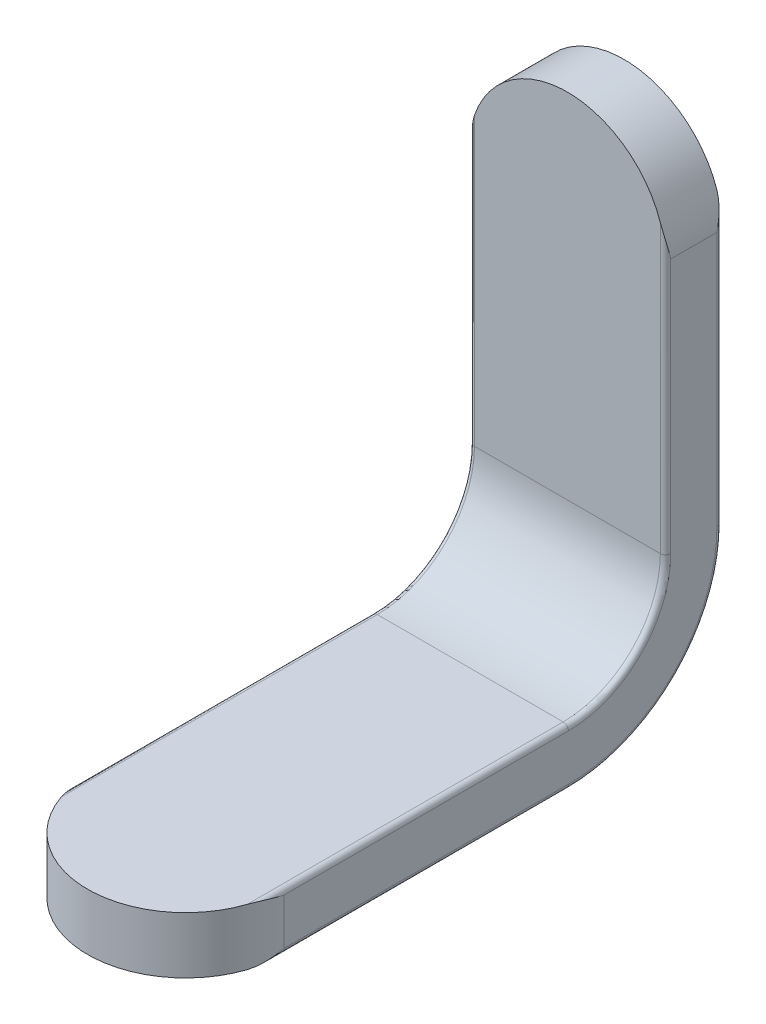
ISO-10303-21;
HEADER;
FILE_DESCRIPTION(('STEP AP214'),'2;1');
FILE_NAME('part.step','',(''),(''),'','','');
FILE_SCHEMA(('AUTOMOTIVE_DESIGN { 1 0 10303 214 1 1 1 1 }'));
ENDSEC;
DATA;
#1=APPLICATION_CONTEXT('core data for automotive mechanical design processes');
#2=APPLICATION_PROTOCOL_DEFINITION('international standard','automotive_design',2000,#1);
#3=PRODUCT_CONTEXT('',#1,'mechanical');
#4=PRODUCT('Part','Part','',(#3));
#5=PRODUCT_RELATED_PRODUCT_CATEGORY('part','',(#4));
#6=PRODUCT_DEFINITION_FORMATION('','',#4);
#7=PRODUCT_DEFINITION_CONTEXT('part definition',#1,'design');
#8=PRODUCT_DEFINITION('design','',#6,#7);
#9=PRODUCT_DEFINITION_SHAPE('','',#8);
#10=(LENGTH_UNIT() NAMED_UNIT(*) SI_UNIT(.MILLI.,.METRE.));
#11=(NAMED_UNIT(*) PLANE_ANGLE_UNIT() SI_UNIT($,.RADIAN.));
#12=(NAMED_UNIT(*) SI_UNIT($,.STERADIAN.) SOLID_ANGLE_UNIT());
#13=UNCERTAINTY_MEASURE_WITH_UNIT(LENGTH_MEASURE(1.E-05),#10,'distance_accuracy_value','');
#14=(GEOMETRIC_REPRESENTATION_CONTEXT(3) GLOBAL_UNCERTAINTY_ASSIGNED_CONTEXT((#13)) GLOBAL_UNIT_ASSIGNED_CONTEXT((#10,
#11,#12)) REPRESENTATION_CONTEXT('',''));
#15=CARTESIAN_POINT('',(0.,0.,0.));
#16=DIRECTION('',(0.,0.,1.));
#17=DIRECTION('',(1.,0.,0.));
#18=AXIS2_PLACEMENT_3D('',#15,#16,#17);
#19=CARTESIAN_POINT('',(0.,125.,0.));
#20=DIRECTION('',(0.,0.,1.));
#21=DIRECTION('',(1.,0.,0.));
#22=AXIS2_PLACEMENT_3D('',#19,#20,#21);
#23=CYLINDRICAL_SURFACE('',#22,30.);
#24=CARTESIAN_POINT('',(28.41,134.637006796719,17.3));
#25=CARTESIAN_POINT('',(28.4528668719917,134.510636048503,17.2999913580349));
#26=CARTESIAN_POINT('',(28.494885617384,134.38399127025,17.298267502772));
#27=CARTESIAN_POINT('',(28.5772027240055,134.130239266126,17.2917248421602));
#28=CARTESIAN_POINT('',(28.6175012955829,134.003132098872,17.2869064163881));
#29=CARTESIAN_POINT('',(28.7357392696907,133.621382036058,17.2683205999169));
#30=CARTESIAN_POINT('',(28.8110826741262,133.366128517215,17.2504216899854));
#31=CARTESIAN_POINT('',(28.9546638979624,132.854800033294,17.2056882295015));
#32=CARTESIAN_POINT('',(29.0229107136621,132.598726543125,17.1788651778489));
#33=CARTESIAN_POINT('',(29.1524241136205,132.085633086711,17.1178460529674));
#34=CARTESIAN_POINT('',(29.2136888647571,131.828612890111,17.0836480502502));
#35=CARTESIAN_POINT('',(29.3322213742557,131.300613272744,17.0072406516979));
#36=CARTESIAN_POINT('',(29.3891197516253,131.029597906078,16.9647089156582));
#37=CARTESIAN_POINT('',(29.4952454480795,130.486978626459,16.8741330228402));
#38=CARTESIAN_POINT('',(29.544472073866,130.21537466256,16.8260883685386));
#39=CARTESIAN_POINT('',(29.6807386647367,129.39973999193,16.6752512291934));
#40=CARTESIAN_POINT('',(29.7563413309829,128.854993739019,16.5657719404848));
#41=CARTESIAN_POINT('',(29.8774145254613,127.764308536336,16.3358413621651));
#42=CARTESIAN_POINT('',(29.9228705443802,127.218369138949,16.2153848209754));
#43=CARTESIAN_POINT('',(29.9838407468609,126.126170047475,15.9692153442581));
#44=CARTESIAN_POINT('',(29.9993665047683,125.579910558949,15.8435044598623));
#45=CARTESIAN_POINT('',(29.9999936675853,125.022505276,15.7151811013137));
#46=CARTESIAN_POINT('',(29.9999999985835,125.011252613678,15.7125905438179));
#47=CARTESIAN_POINT('',(30.,125.,15.71));
#48=B_SPLINE_CURVE_WITH_KNOTS('',3,(#24,#25,#26,#27,#28,#29,#30,#31,#32,#33,#34,#35,#36,#37,#38,
#39,#40,#41,#42,#43,#44,#45,#46,#47),.UNSPECIFIED.,.F.,.F.,(4,2,2,2,2,2,2,2,2,2,2,4),(0.,
0.400295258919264,0.800541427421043,1.60045769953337,2.39934723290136,3.1984460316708,
4.03877949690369,4.87918885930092,6.56034026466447,8.24230020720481,9.92360958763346,
9.95825060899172),.UNSPECIFIED.);
#49=CARTESIAN_POINT('',(30.,125.,15.71));
#50=VERTEX_POINT('',#49);
#51=CARTESIAN_POINT('',(28.41,134.637006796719,17.3));
#52=VERTEX_POINT('',#51);
#53=EDGE_CURVE('E180',#50,#52,#48,.F.);
#54=ORIENTED_EDGE('',*,*,#53,.F.);
#55=DIRECTION('',(0.,0.,1.));
#56=VECTOR('',#55,1.);
#57=CARTESIAN_POINT('',(30.,125.,0.));
#58=LINE('',#57,#56);
#59=CARTESIAN_POINT('',(30.,125.,1.59000000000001));
#60=VERTEX_POINT('',#59);
#61=EDGE_CURVE('E353',#60,#50,#58,.T.);
#62=ORIENTED_EDGE('',*,*,#61,.F.);
#63=CARTESIAN_POINT('',(28.41,134.637006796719,0.));
#64=CARTESIAN_POINT('',(28.4528668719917,134.510636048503,8.6419651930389E-06));
#65=CARTESIAN_POINT('',(28.494885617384,134.38399127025,0.00173249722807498));
#66=CARTESIAN_POINT('',(28.5772027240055,134.130239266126,0.00827515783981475));
#67=CARTESIAN_POINT('',(28.617501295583,134.003132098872,0.0130935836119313));
#68=CARTESIAN_POINT('',(28.7357392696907,133.621382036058,0.0316794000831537));
#69=CARTESIAN_POINT('',(28.8110826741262,133.366128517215,0.0495783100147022));
#70=CARTESIAN_POINT('',(28.9546638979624,132.854800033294,0.094311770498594));
#71=CARTESIAN_POINT('',(29.0229107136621,132.598726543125,0.121134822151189));
#72=CARTESIAN_POINT('',(29.1524241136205,132.08563308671,0.182153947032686));
#73=CARTESIAN_POINT('',(29.2136888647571,131.828612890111,0.216351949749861));
#74=CARTESIAN_POINT('',(29.3322213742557,131.300613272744,0.292759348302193));
#75=CARTESIAN_POINT('',(29.3891197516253,131.029597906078,0.335291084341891));
#76=CARTESIAN_POINT('',(29.4952454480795,130.486978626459,0.425866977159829));
#77=CARTESIAN_POINT('',(29.544472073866,130.21537466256,0.473911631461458));
#78=CARTESIAN_POINT('',(29.6807386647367,129.39973999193,0.62474877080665));
#79=CARTESIAN_POINT('',(29.7563413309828,128.854993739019,0.73422805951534));
#80=CARTESIAN_POINT('',(29.8774145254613,127.764308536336,0.964158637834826));
#81=CARTESIAN_POINT('',(29.9228705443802,127.218369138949,1.08461517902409));
#82=CARTESIAN_POINT('',(29.9838407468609,126.126170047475,1.33078465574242));
#83=CARTESIAN_POINT('',(29.9993665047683,125.57991055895,1.45649554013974));
#84=CARTESIAN_POINT('',(29.9999936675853,125.022505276,1.58481889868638));
#85=CARTESIAN_POINT('',(29.9999999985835,125.011252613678,1.58740945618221));
#86=CARTESIAN_POINT('',(30.,125.,1.59000000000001));
#87=B_SPLINE_CURVE_WITH_KNOTS('',3,(#63,#64,#65,#66,#67,#68,#69,#70,#71,#72,#73,#74,#75,#76,#77,
#78,#79,#80,#81,#82,#83,#84,#85,#86),.UNSPECIFIED.,.F.,.F.,(4,2,2,2,2,2,2,2,2,2,2,4),(0.,
0.400295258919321,0.800541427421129,1.60045769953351,2.39934723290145,3.1984460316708,
4.03877949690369,4.87918885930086,6.56034026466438,8.24230020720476,9.92360958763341,
9.95825060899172),.UNSPECIFIED.);
#88=CARTESIAN_POINT('',(28.41,134.637006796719,0.));
#89=VERTEX_POINT('',#88);
#90=EDGE_CURVE('E221',#89,#60,#87,.T.);
#91=ORIENTED_EDGE('',*,*,#90,.F.);
#92=CARTESIAN_POINT('',(0.,125.,0.));
#93=DIRECTION('',(0.,0.,-1.));
#94=DIRECTION('',(1.,0.,0.));
#95=AXIS2_PLACEMENT_3D('',#92,#93,#94);
#96=CIRCLE('',#95,30.);
#97=CARTESIAN_POINT('',(-28.41,134.637006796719,0.));
#98=VERTEX_POINT('',#97);
#99=EDGE_CURVE('E350',#98,#89,#96,.T.);
#100=ORIENTED_EDGE('',*,*,#99,.F.);
#101=CARTESIAN_POINT('',(-28.41,134.637006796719,0.));
#102=CARTESIAN_POINT('',(-28.4528668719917,134.510636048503,8.6419651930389E-06));
#103=CARTESIAN_POINT('',(-28.494885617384,134.38399127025,0.00173249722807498));
#104=CARTESIAN_POINT('',(-28.5772027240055,134.130239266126,0.00827515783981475));
#105=CARTESIAN_POINT('',(-28.617501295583,134.003132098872,0.0130935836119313));
#106=CARTESIAN_POINT('',(-28.7357392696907,133.621382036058,0.0316794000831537));
#107=CARTESIAN_POINT('',(-28.8110826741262,133.366128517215,0.0495783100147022));
#108=CARTESIAN_POINT('',(-28.9546638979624,132.854800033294,0.094311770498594));
#109=CARTESIAN_POINT('',(-29.0229107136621,132.598726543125,0.121134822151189));
#110=CARTESIAN_POINT('',(-29.1524241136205,132.08563308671,0.182153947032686));
#111=CARTESIAN_POINT('',(-29.2136888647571,131.828612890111,0.216351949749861));
#112=CARTESIAN_POINT('',(-29.3322213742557,131.300613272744,0.292759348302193));
#113=CARTESIAN_POINT('',(-29.3891197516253,131.029597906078,0.335291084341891));
#114=CARTESIAN_POINT('',(-29.4952454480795,130.486978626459,0.425866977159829));
#115=CARTESIAN_POINT('',(-29.544472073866,130.21537466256,0.473911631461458));
#116=CARTESIAN_POINT('',(-29.6807386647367,129.39973999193,0.62474877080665));
#117=CARTESIAN_POINT('',(-29.7563413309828,128.854993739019,0.73422805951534));
#118=CARTESIAN_POINT('',(-29.8774145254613,127.764308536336,0.964158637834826));
#119=CARTESIAN_POINT('',(-29.9228705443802,127.218369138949,1.08461517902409));
#120=CARTESIAN_POINT('',(-29.9838407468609,126.126170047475,1.33078465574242));
#121=CARTESIAN_POINT('',(-29.9993665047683,125.57991055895,1.45649554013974));
#122=CARTESIAN_POINT('',(-29.9999936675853,125.022505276,1.58481889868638));
#123=CARTESIAN_POINT('',(-29.9999999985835,125.011252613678,1.58740945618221));
#124=CARTESIAN_POINT('',(-30.,125.,1.59000000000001));
#125=B_SPLINE_CURVE_WITH_KNOTS('',3,(#101,#102,#103,#104,#105,#106,#107,#108,#109,#110,#111,
#112,#113,#114,#115,#116,#117,#118,#119,#120,#121,#122,#123,#124),.UNSPECIFIED.,.F.,.F.,(4,2,2,
2,2,2,2,2,2,2,2,4),(0.,0.400295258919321,0.800541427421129,1.60045769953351,2.39934723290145,
3.1984460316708,4.03877949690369,4.87918885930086,6.56034026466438,8.24230020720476,
9.92360958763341,9.95825060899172),.UNSPECIFIED.);
#126=CARTESIAN_POINT('',(-30.,125.,1.59000000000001));
#127=VERTEX_POINT('',#126);
#128=EDGE_CURVE('E213',#127,#98,#125,.F.);
#129=ORIENTED_EDGE('',*,*,#128,.F.);
#130=DIRECTION('',(0.,0.,1.));
#131=VECTOR('',#130,1.);
#132=CARTESIAN_POINT('',(-30.,125.,0.));
#133=LINE('',#132,#131);
#134=CARTESIAN_POINT('',(-30.,125.,15.71));
#135=VERTEX_POINT('',#134);
#136=EDGE_CURVE('E292',#127,#135,#133,.T.);
#137=ORIENTED_EDGE('',*,*,#136,.T.);
#138=CARTESIAN_POINT('',(-28.41,134.637006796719,17.3));
#139=CARTESIAN_POINT('',(-28.4528668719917,134.510636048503,17.2999913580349));
#140=CARTESIAN_POINT('',(-28.494885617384,134.38399127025,17.298267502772));
#141=CARTESIAN_POINT('',(-28.5772027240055,134.130239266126,17.2917248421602));
#142=CARTESIAN_POINT('',(-28.6175012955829,134.003132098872,17.2869064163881));
#143=CARTESIAN_POINT('',(-28.7357392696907,133.621382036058,17.2683205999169));
#144=CARTESIAN_POINT('',(-28.8110826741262,133.366128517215,17.2504216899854));
#145=CARTESIAN_POINT('',(-28.9546638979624,132.854800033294,17.2056882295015));
#146=CARTESIAN_POINT('',(-29.0229107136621,132.598726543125,17.1788651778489));
#147=CARTESIAN_POINT('',(-29.1524241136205,132.085633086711,17.1178460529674));
#148=CARTESIAN_POINT('',(-29.2136888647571,131.828612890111,17.0836480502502));
#149=CARTESIAN_POINT('',(-29.3322213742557,131.300613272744,17.0072406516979));
#150=CARTESIAN_POINT('',(-29.3891197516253,131.029597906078,16.9647089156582));
#151=CARTESIAN_POINT('',(-29.4952454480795,130.486978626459,16.8741330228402));
#152=CARTESIAN_POINT('',(-29.544472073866,130.21537466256,16.8260883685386));
#153=CARTESIAN_POINT('',(-29.6807386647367,129.39973999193,16.6752512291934));
#154=CARTESIAN_POINT('',(-29.7563413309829,128.854993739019,16.5657719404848));
#155=CARTESIAN_POINT('',(-29.8774145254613,127.764308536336,16.3358413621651));
#156=CARTESIAN_POINT('',(-29.9228705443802,127.218369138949,16.2153848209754));
#157=CARTESIAN_POINT('',(-29.9838407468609,126.126170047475,15.9692153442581));
#158=CARTESIAN_POINT('',(-29.9993665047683,125.579910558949,15.8435044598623));
#159=CARTESIAN_POINT('',(-29.9999936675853,125.022505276,15.7151811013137));
#160=CARTESIAN_POINT('',(-29.9999999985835,125.011252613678,15.7125905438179));
#161=CARTESIAN_POINT('',(-30.,125.,15.71));
#162=B_SPLINE_CURVE_WITH_KNOTS('',3,(#138,#139,#140,#141,#142,#143,#144,#145,#146,#147,#148,
#149,#150,#151,#152,#153,#154,#155,#156,#157,#158,#159,#160,#161),.UNSPECIFIED.,.F.,.F.,(4,2,2,
2,2,2,2,2,2,2,2,4),(0.,0.400295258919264,0.800541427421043,1.60045769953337,2.39934723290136,
3.1984460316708,4.03877949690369,4.87918885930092,6.56034026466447,8.24230020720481,
9.92360958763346,9.95825060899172),.UNSPECIFIED.);
#163=CARTESIAN_POINT('',(-28.41,134.637006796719,17.3));
#164=VERTEX_POINT('',#163);
#165=EDGE_CURVE('E205',#164,#135,#162,.T.);
#166=ORIENTED_EDGE('',*,*,#165,.F.);
#167=CARTESIAN_POINT('',(0.,125.,17.3));
#168=DIRECTION('',(0.,0.,-1.));
#169=DIRECTION('',(1.,0.,0.));
#170=AXIS2_PLACEMENT_3D('',#167,#168,#169);
#171=CIRCLE('',#170,30.);
#172=EDGE_CURVE('E347',#164,#52,#171,.T.);
#173=ORIENTED_EDGE('',*,*,#172,.T.);
#174=EDGE_LOOP('',(#54,#62,#91,#100,#129,#137,#166,#173));
#175=FACE_BOUND('',#174,.T.);
#176=ADVANCED_FACE('F33',(#175),#23,.T.);
#177=CARTESIAN_POINT('',(30.,47.,47.));
#178=DIRECTION('',(-1.,0.,0.));
#179=DIRECTION('',(0.,0.,1.));
#180=AXIS2_PLACEMENT_3D('',#177,#178,#179);
#181=PLANE('',#180);
#182=DIRECTION('',(0.,1.,0.));
#183=VECTOR('',#182,1.);
#184=CARTESIAN_POINT('',(30.,47.,15.71));
#185=LINE('',#184,#183);
#186=CARTESIAN_POINT('',(30.,47.,15.71));
#187=VERTEX_POINT('',#186);
#188=EDGE_CURVE('E170',#187,#50,#185,.T.);
#189=ORIENTED_EDGE('',*,*,#188,.F.);
#190=CARTESIAN_POINT('',(30.,47.,47.));
#191=DIRECTION('',(1.,0.,0.));
#192=DIRECTION('',(0.,0.,-1.));
#193=AXIS2_PLACEMENT_3D('',#190,#191,#192);
#194=CIRCLE('',#193,31.29);
#195=CARTESIAN_POINT('',(30.,15.71,47.));
#196=VERTEX_POINT('',#195);
#197=EDGE_CURVE('E163',#196,#187,#194,.T.);
#198=ORIENTED_EDGE('',*,*,#197,.F.);
#199=DIRECTION('',(0.,0.,1.));
#200=VECTOR('',#199,1.);
#201=CARTESIAN_POINT('',(30.,15.71,47.));
#202=LINE('',#201,#200);
#203=CARTESIAN_POINT('',(30.,15.71,134.));
#204=VERTEX_POINT('',#203);
#205=EDGE_CURVE('E150',#196,#204,#202,.T.);
#206=ORIENTED_EDGE('',*,*,#205,.T.);
#207=DIRECTION('',(0.,1.,0.));
#208=VECTOR('',#207,1.);
#209=CARTESIAN_POINT('',(30.,0.,134.));
#210=LINE('',#209,#208);
#211=CARTESIAN_POINT('',(30.,1.59000000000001,134.));
#212=VERTEX_POINT('',#211);
#213=EDGE_CURVE('E345',#212,#204,#210,.T.);
#214=ORIENTED_EDGE('',*,*,#213,.F.);
#215=DIRECTION('',(0.,0.,1.));
#216=VECTOR('',#215,1.);
#217=CARTESIAN_POINT('',(30.,1.59000000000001,47.));
#218=LINE('',#217,#216);
#219=CARTESIAN_POINT('',(30.,1.59000000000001,47.));
#220=VERTEX_POINT('',#219);
#221=EDGE_CURVE('E60',#220,#212,#218,.T.);
#222=ORIENTED_EDGE('',*,*,#221,.F.);
#223=CARTESIAN_POINT('',(30.,47.,47.));
#224=DIRECTION('',(1.,0.,0.));
#225=DIRECTION('',(0.,0.,-1.));
#226=AXIS2_PLACEMENT_3D('',#223,#224,#225);
#227=CIRCLE('',#226,45.41);
#228=CARTESIAN_POINT('',(30.,47.,1.59000000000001));
#229=VERTEX_POINT('',#228);
#230=EDGE_CURVE('E274',#220,#229,#227,.T.);
#231=ORIENTED_EDGE('',*,*,#230,.T.);
#232=DIRECTION('',(0.,1.,0.));
#233=VECTOR('',#232,1.);
#234=CARTESIAN_POINT('',(30.,47.,1.59000000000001));
#235=LINE('',#234,#233);
#236=EDGE_CURVE('E229',#229,#60,#235,.T.);
#237=ORIENTED_EDGE('',*,*,#236,.T.);
#238=ORIENTED_EDGE('',*,*,#61,.T.);
#239=EDGE_LOOP('',(#189,#198,#206,#214,#222,#231,#237,#238));
#240=FACE_BOUND('',#239,.T.);
#241=ADVANCED_FACE('F168',(#240),#181,.F.);
#242=CARTESIAN_POINT('',(30.,47.,47.));
#243=DIRECTION('',(-1.,0.,0.));
#244=DIRECTION('',(0.,0.,1.));
#245=AXIS2_PLACEMENT_3D('',#242,#243,#244);
#246=CYLINDRICAL_SURFACE('',#245,29.7);
#247=CARTESIAN_POINT('',(28.41,47.,47.));
#248=DIRECTION('',(1.,0.,0.));
#249=DIRECTION('',(0.,0.,-1.));
#250=AXIS2_PLACEMENT_3D('',#247,#248,#249);
#251=CIRCLE('',#250,29.7);
#252=CARTESIAN_POINT('',(28.41,17.3,47.));
#253=VERTEX_POINT('',#252);
#254=CARTESIAN_POINT('',(28.41,47.,17.3));
#255=VERTEX_POINT('',#254);
#256=EDGE_CURVE('E166',#253,#255,#251,.T.);
#257=ORIENTED_EDGE('',*,*,#256,.T.);
#258=DIRECTION('',(-1.,0.,0.));
#259=VECTOR('',#258,1.);
#260=CARTESIAN_POINT('',(30.,47.,17.3));
#261=LINE('',#260,#259);
#262=CARTESIAN_POINT('',(-28.41,47.,17.3));
#263=VERTEX_POINT('',#262);
#264=EDGE_CURVE('E290',#255,#263,#261,.T.);
#265=ORIENTED_EDGE('',*,*,#264,.T.);
#266=CARTESIAN_POINT('',(-28.41,47.,47.));
#267=DIRECTION('',(1.,0.,0.));
#268=DIRECTION('',(0.,0.,-1.));
#269=AXIS2_PLACEMENT_3D('',#266,#267,#268);
#270=CIRCLE('',#269,29.7);
#271=CARTESIAN_POINT('',(-28.41,17.3,47.));
#272=VERTEX_POINT('',#271);
#273=EDGE_CURVE('E367',#272,#263,#270,.T.);
#274=ORIENTED_EDGE('',*,*,#273,.F.);
#275=DIRECTION('',(-1.,0.,0.));
#276=VECTOR('',#275,1.);
#277=CARTESIAN_POINT('',(30.,17.3,47.));
#278=LINE('',#277,#276);
#279=EDGE_CURVE('E288',#253,#272,#278,.T.);
#280=ORIENTED_EDGE('',*,*,#279,.F.);
#281=EDGE_LOOP('',(#257,#265,#274,#280));
#282=FACE_BOUND('',#281,.T.);
#283=ADVANCED_FACE('F364',(#282),#246,.F.);
#284=CARTESIAN_POINT('',(30.,0.,47.));
#285=DIRECTION('',(0.,1.,0.));
#286=DIRECTION('',(0.,0.,1.));
#287=AXIS2_PLACEMENT_3D('',#284,#285,#286);
#288=PLANE('',#287);
#289=DIRECTION('',(0.,0.,1.));
#290=VECTOR('',#289,1.);
#291=CARTESIAN_POINT('',(28.41,0.,47.));
#292=LINE('',#291,#290);
#293=CARTESIAN_POINT('',(28.41,0.,47.));
#294=VERTEX_POINT('',#293);
#295=CARTESIAN_POINT('',(28.41,0.,143.637006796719));
#296=VERTEX_POINT('',#295);
#297=EDGE_CURVE('E262',#294,#296,#292,.T.);
#298=ORIENTED_EDGE('',*,*,#297,.T.);
#299=CARTESIAN_POINT('',(0.,0.,134.));
#300=DIRECTION('',(0.,1.,0.));
#301=DIRECTION('',(0.,0.,1.));
#302=AXIS2_PLACEMENT_3D('',#299,#300,#301);
#303=CIRCLE('',#302,30.);
#304=CARTESIAN_POINT('',(-28.41,0.,143.637006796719));
#305=VERTEX_POINT('',#304);
#306=EDGE_CURVE('E297',#296,#305,#303,.F.);
#307=ORIENTED_EDGE('',*,*,#306,.T.);
#308=DIRECTION('',(0.,0.,1.));
#309=VECTOR('',#308,1.);
#310=CARTESIAN_POINT('',(-28.41,0.,47.));
#311=LINE('',#310,#309);
#312=CARTESIAN_POINT('',(-28.41,0.,47.));
#313=VERTEX_POINT('',#312);
#314=EDGE_CURVE('E287',#313,#305,#311,.T.);
#315=ORIENTED_EDGE('',*,*,#314,.F.);
#316=DIRECTION('',(-1.,0.,0.));
#317=VECTOR('',#316,1.);
#318=CARTESIAN_POINT('',(30.,0.,47.));
#319=LINE('',#318,#317);
#320=EDGE_CURVE('E279',#294,#313,#319,.T.);
#321=ORIENTED_EDGE('',*,*,#320,.F.);
#322=EDGE_LOOP('',(#298,#307,#315,#321));
#323=FACE_BOUND('',#322,.T.);
#324=ADVANCED_FACE('F285',(#323),#288,.F.);
#325=CARTESIAN_POINT('',(30.,47.,47.));
#326=DIRECTION('',(-1.,0.,0.));
#327=DIRECTION('',(0.,0.,1.));
#328=AXIS2_PLACEMENT_3D('',#325,#326,#327);
#329=CYLINDRICAL_SURFACE('',#328,47.);
#330=CARTESIAN_POINT('',(28.41,47.,47.));
#331=DIRECTION('',(1.,0.,0.));
#332=DIRECTION('',(0.,0.,-1.));
#333=AXIS2_PLACEMENT_3D('',#330,#331,#332);
#334=CIRCLE('',#333,47.);
#335=CARTESIAN_POINT('',(28.41,47.,0.));
#336=VERTEX_POINT('',#335);
#337=EDGE_CURVE('E271',#294,#336,#334,.T.);
#338=ORIENTED_EDGE('',*,*,#337,.F.);
#339=ORIENTED_EDGE('',*,*,#320,.T.);
#340=CARTESIAN_POINT('',(-28.41,47.,47.));
#341=DIRECTION('',(1.,0.,0.));
#342=DIRECTION('',(0.,0.,-1.));
#343=AXIS2_PLACEMENT_3D('',#340,#341,#342);
#344=CIRCLE('',#343,47.);
#345=CARTESIAN_POINT('',(-28.41,47.,0.));
#346=VERTEX_POINT('',#345);
#347=EDGE_CURVE('E387',#313,#346,#344,.T.);
#348=ORIENTED_EDGE('',*,*,#347,.T.);
#349=DIRECTION('',(-1.,0.,0.));
#350=VECTOR('',#349,1.);
#351=CARTESIAN_POINT('',(30.,47.,0.));
#352=LINE('',#351,#350);
#353=EDGE_CURVE('E281',#336,#346,#352,.T.);
#354=ORIENTED_EDGE('',*,*,#353,.F.);
#355=EDGE_LOOP('',(#338,#339,#348,#354));
#356=FACE_BOUND('',#355,.T.);
#357=ADVANCED_FACE('F277',(#356),#329,.T.);
#358=CARTESIAN_POINT('',(30.,155.,0.));
#359=DIRECTION('',(0.,0.,1.));
#360=DIRECTION('',(0.,-1.,0.));
#361=AXIS2_PLACEMENT_3D('',#358,#359,#360);
#362=PLANE('',#361);
#363=DIRECTION('',(0.,1.,0.));
#364=VECTOR('',#363,1.);
#365=CARTESIAN_POINT('',(28.41,47.,0.));
#366=LINE('',#365,#364);
#367=EDGE_CURVE('E409',#336,#89,#366,.T.);
#368=ORIENTED_EDGE('',*,*,#367,.F.);
#369=ORIENTED_EDGE('',*,*,#353,.T.);
#370=DIRECTION('',(0.,1.,0.));
#371=VECTOR('',#370,1.);
#372=CARTESIAN_POINT('',(-28.41,47.,0.));
#373=LINE('',#372,#371);
#374=EDGE_CURVE('E380',#346,#98,#373,.T.);
#375=ORIENTED_EDGE('',*,*,#374,.T.);
#376=ORIENTED_EDGE('',*,*,#99,.T.);
#377=EDGE_LOOP('',(#368,#369,#375,#376));
#378=FACE_BOUND('',#377,.T.);
#379=ADVANCED_FACE('F410',(#378),#362,.F.);
#380=CARTESIAN_POINT('',(-30.,47.,47.));
#381=DIRECTION('',(-1.,0.,0.));
#382=DIRECTION('',(0.,0.,1.));
#383=AXIS2_PLACEMENT_3D('',#380,#381,#382);
#384=PLANE('',#383);
#385=DIRECTION('',(0.,1.,0.));
#386=VECTOR('',#385,1.);
#387=CARTESIAN_POINT('',(-30.,47.,1.59000000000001));
#388=LINE('',#387,#386);
#389=CARTESIAN_POINT('',(-30.,47.,1.59000000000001));
#390=VERTEX_POINT('',#389);
#391=EDGE_CURVE('E385',#390,#127,#388,.T.);
#392=ORIENTED_EDGE('',*,*,#391,.F.);
#393=CARTESIAN_POINT('',(-30.,47.,47.));
#394=DIRECTION('',(1.,0.,0.));
#395=DIRECTION('',(0.,0.,-1.));
#396=AXIS2_PLACEMENT_3D('',#393,#394,#395);
#397=CIRCLE('',#396,45.41);
#398=CARTESIAN_POINT('',(-30.,1.59000000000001,47.));
#399=VERTEX_POINT('',#398);
#400=EDGE_CURVE('E391',#399,#390,#397,.T.);
#401=ORIENTED_EDGE('',*,*,#400,.F.);
#402=DIRECTION('',(0.,0.,1.));
#403=VECTOR('',#402,1.);
#404=CARTESIAN_POINT('',(-30.,1.59000000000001,47.));
#405=LINE('',#404,#403);
#406=CARTESIAN_POINT('',(-30.,1.59000000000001,134.));
#407=VERTEX_POINT('',#406);
#408=EDGE_CURVE('E396',#399,#407,#405,.T.);
#409=ORIENTED_EDGE('',*,*,#408,.T.);
#410=DIRECTION('',(0.,1.,0.));
#411=VECTOR('',#410,1.);
#412=CARTESIAN_POINT('',(-30.,0.,134.));
#413=LINE('',#412,#411);
#414=CARTESIAN_POINT('',(-30.,15.71,134.));
#415=VERTEX_POINT('',#414);
#416=EDGE_CURVE('E340',#407,#415,#413,.T.);
#417=ORIENTED_EDGE('',*,*,#416,.T.);
#418=DIRECTION('',(0.,0.,1.));
#419=VECTOR('',#418,1.);
#420=CARTESIAN_POINT('',(-30.,15.71,47.));
#421=LINE('',#420,#419);
#422=CARTESIAN_POINT('',(-30.,15.71,47.));
#423=VERTEX_POINT('',#422);
#424=EDGE_CURVE('E369',#423,#415,#421,.T.);
#425=ORIENTED_EDGE('',*,*,#424,.F.);
#426=CARTESIAN_POINT('',(-30.,47.,47.));
#427=DIRECTION('',(1.,0.,0.));
#428=DIRECTION('',(0.,0.,-1.));
#429=AXIS2_PLACEMENT_3D('',#426,#427,#428);
#430=CIRCLE('',#429,31.29);
#431=CARTESIAN_POINT('',(-30.,47.,15.71));
#432=VERTEX_POINT('',#431);
#433=EDGE_CURVE('E337',#423,#432,#430,.T.);
#434=ORIENTED_EDGE('',*,*,#433,.T.);
#435=DIRECTION('',(0.,1.,0.));
#436=VECTOR('',#435,1.);
#437=CARTESIAN_POINT('',(-30.,47.,15.71));
#438=LINE('',#437,#436);
#439=EDGE_CURVE('E326',#432,#135,#438,.T.);
#440=ORIENTED_EDGE('',*,*,#439,.T.);
#441=ORIENTED_EDGE('',*,*,#136,.F.);
#442=EDGE_LOOP('',(#392,#401,#409,#417,#425,#434,#440,#441));
#443=FACE_BOUND('',#442,.T.);
#444=ADVANCED_FACE('F200',(#443),#384,.T.);
#445=CARTESIAN_POINT('',(30.,155.,17.3));
#446=DIRECTION('',(0.,0.,-1.));
#447=DIRECTION('',(0.,1.,0.));
#448=AXIS2_PLACEMENT_3D('',#445,#446,#447);
#449=PLANE('',#448);
#450=ORIENTED_EDGE('',*,*,#264,.F.);
#451=DIRECTION('',(0.,1.,0.));
#452=VECTOR('',#451,1.);
#453=CARTESIAN_POINT('',(28.41,47.,17.3));
#454=LINE('',#453,#452);
#455=EDGE_CURVE('E177',#255,#52,#454,.T.);
#456=ORIENTED_EDGE('',*,*,#455,.T.);
#457=ORIENTED_EDGE('',*,*,#172,.F.);
#458=DIRECTION('',(0.,1.,0.));
#459=VECTOR('',#458,1.);
#460=CARTESIAN_POINT('',(-28.41,47.,17.3));
#461=LINE('',#460,#459);
#462=EDGE_CURVE('E329',#263,#164,#461,.T.);
#463=ORIENTED_EDGE('',*,*,#462,.F.);
#464=EDGE_LOOP('',(#450,#456,#457,#463));
#465=FACE_BOUND('',#464,.T.);
#466=ADVANCED_FACE('F35',(#465),#449,.F.);
#467=CARTESIAN_POINT('',(30.,17.3,47.));
#468=DIRECTION('',(0.,-1.,0.));
#469=DIRECTION('',(0.,0.,-1.));
#470=AXIS2_PLACEMENT_3D('',#467,#468,#469);
#471=PLANE('',#470);
#472=CARTESIAN_POINT('',(0.,17.3,134.));
#473=DIRECTION('',(0.,-1.,0.));
#474=DIRECTION('',(0.,0.,1.));
#475=AXIS2_PLACEMENT_3D('',#472,#473,#474);
#476=CIRCLE('',#475,30.);
#477=CARTESIAN_POINT('',(28.41,17.3,143.637006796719));
#478=VERTEX_POINT('',#477);
#479=CARTESIAN_POINT('',(-28.41,17.3,143.637006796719));
#480=VERTEX_POINT('',#479);
#481=EDGE_CURVE('E338',#478,#480,#476,.T.);
#482=ORIENTED_EDGE('',*,*,#481,.F.);
#483=DIRECTION('',(0.,0.,1.));
#484=VECTOR('',#483,1.);
#485=CARTESIAN_POINT('',(28.41,17.3,47.));
#486=LINE('',#485,#484);
#487=EDGE_CURVE('E53',#253,#478,#486,.T.);
#488=ORIENTED_EDGE('',*,*,#487,.F.);
#489=ORIENTED_EDGE('',*,*,#279,.T.);
#490=DIRECTION('',(0.,0.,1.));
#491=VECTOR('',#490,1.);
#492=CARTESIAN_POINT('',(-28.41,17.3,47.));
#493=LINE('',#492,#491);
#494=EDGE_CURVE('E376',#272,#480,#493,.T.);
#495=ORIENTED_EDGE('',*,*,#494,.T.);
#496=EDGE_LOOP('',(#482,#488,#489,#495));
#497=FACE_BOUND('',#496,.T.);
#498=ADVANCED_FACE('F320',(#497),#471,.F.);
#499=CARTESIAN_POINT('',(0.,0.,134.));
#500=DIRECTION('',(0.,1.,0.));
#501=DIRECTION('',(0.,0.,1.));
#502=AXIS2_PLACEMENT_3D('',#499,#500,#501);
#503=CYLINDRICAL_SURFACE('',#502,30.);
#504=ORIENTED_EDGE('',*,*,#213,.T.);
#505=CARTESIAN_POINT('',(28.41,17.3,143.637006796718));
#506=CARTESIAN_POINT('',(28.4528668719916,17.2999913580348,143.510636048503));
#507=CARTESIAN_POINT('',(28.4948856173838,17.298267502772,143.383991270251));
#508=CARTESIAN_POINT('',(28.5772027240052,17.2917248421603,143.130239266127));
#509=CARTESIAN_POINT('',(28.6175012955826,17.2869064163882,143.003132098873));
#510=CARTESIAN_POINT('',(28.7357392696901,17.268320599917,142.621382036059));
#511=CARTESIAN_POINT('',(28.8110826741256,17.2504216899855,142.366128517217));
#512=CARTESIAN_POINT('',(28.9546638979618,17.2056882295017,141.854800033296));
#513=CARTESIAN_POINT('',(29.0229107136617,17.178865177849,141.598726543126));
#514=CARTESIAN_POINT('',(29.1524241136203,17.1178460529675,141.085633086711));
#515=CARTESIAN_POINT('',(29.213688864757,17.0836480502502,140.828612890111));
#516=CARTESIAN_POINT('',(29.3322213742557,17.0072406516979,140.300613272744));
#517=CARTESIAN_POINT('',(29.3891197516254,16.9647089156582,140.029597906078));
#518=CARTESIAN_POINT('',(29.4952454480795,16.8741330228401,139.486978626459));
#519=CARTESIAN_POINT('',(29.544472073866,16.8260883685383,139.215374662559));
#520=CARTESIAN_POINT('',(29.6807386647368,16.6752512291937,138.399739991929));
#521=CARTESIAN_POINT('',(29.756341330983,16.565771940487,137.854993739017));
#522=CARTESIAN_POINT('',(29.8774145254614,16.3358413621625,136.764308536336));
#523=CARTESIAN_POINT('',(29.9228705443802,16.2153848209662,136.21836913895));
#524=CARTESIAN_POINT('',(29.9838407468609,15.9692153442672,135.126170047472));
#525=CARTESIAN_POINT('',(29.9993665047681,15.8435044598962,134.579910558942));
#526=CARTESIAN_POINT('',(29.9999936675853,15.7151811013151,134.022505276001));
#527=CARTESIAN_POINT('',(29.9999999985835,15.7125905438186,134.011252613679));
#528=CARTESIAN_POINT('',(30.,15.71,134.000000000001));
#529=B_SPLINE_CURVE_WITH_KNOTS('',3,(#505,#506,#507,#508,#509,#510,#511,#512,#513,#514,#515,
#516,#517,#518,#519,#520,#521,#522,#523,#524,#525,#526,#527,#528),.UNSPECIFIED.,.F.,.F.,(4,2,2,
2,2,2,2,2,2,2,2,4),(0.,0.400295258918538,0.800541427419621,1.60045769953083,2.39934723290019,
3.19844603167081,4.03877949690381,4.87918885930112,6.56034026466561,8.24230020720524,
9.92360958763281,9.95825060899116),.UNSPECIFIED.);
#530=EDGE_CURVE('E11',#204,#478,#529,.F.);
#531=ORIENTED_EDGE('',*,*,#530,.T.);
#532=ORIENTED_EDGE('',*,*,#481,.T.);
#533=CARTESIAN_POINT('',(-28.41,17.3,143.637006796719));
#534=CARTESIAN_POINT('',(-28.4528668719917,17.2999913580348,143.510636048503));
#535=CARTESIAN_POINT('',(-28.494885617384,17.298267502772,143.38399127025));
#536=CARTESIAN_POINT('',(-28.5772027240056,17.2917248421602,143.130239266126));
#537=CARTESIAN_POINT('',(-28.6175012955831,17.2869064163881,143.003132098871));
#538=CARTESIAN_POINT('',(-28.7357392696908,17.2683205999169,142.621382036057));
#539=CARTESIAN_POINT('',(-28.8110826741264,17.2504216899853,142.366128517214));
#540=CARTESIAN_POINT('',(-28.9546638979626,17.2056882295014,141.854800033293));
#541=CARTESIAN_POINT('',(-29.0229107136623,17.1788651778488,141.598726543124));
#542=CARTESIAN_POINT('',(-29.1524241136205,17.1178460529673,141.08563308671));
#543=CARTESIAN_POINT('',(-29.2136888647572,17.0836480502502,140.82861289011));
#544=CARTESIAN_POINT('',(-29.3322213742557,17.0072406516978,140.300613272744));
#545=CARTESIAN_POINT('',(-29.3891197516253,16.9647089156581,140.029597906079));
#546=CARTESIAN_POINT('',(-29.4952454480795,16.8741330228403,139.486978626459));
#547=CARTESIAN_POINT('',(-29.5444720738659,16.8260883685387,139.21537466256));
#548=CARTESIAN_POINT('',(-29.6807386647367,16.6752512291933,138.399739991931));
#549=CARTESIAN_POINT('',(-29.7563413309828,16.5657719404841,137.85499373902));
#550=CARTESIAN_POINT('',(-29.8774145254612,16.3358413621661,136.764308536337));
#551=CARTESIAN_POINT('',(-29.9228705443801,16.2153848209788,136.218369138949));
#552=CARTESIAN_POINT('',(-29.9838407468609,15.969215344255,135.126170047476));
#553=CARTESIAN_POINT('',(-29.9993665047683,15.8435044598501,134.579910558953));
#554=CARTESIAN_POINT('',(-29.9999936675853,15.7151811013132,134.022505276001));
#555=CARTESIAN_POINT('',(-29.9999999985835,15.7125905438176,134.011252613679));
#556=CARTESIAN_POINT('',(-30.,15.71,134.000000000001));
#557=B_SPLINE_CURVE_WITH_KNOTS('',3,(#533,#534,#535,#536,#537,#538,#539,#540,#541,#542,#543,
#544,#545,#546,#547,#548,#549,#550,#551,#552,#553,#554,#555,#556),.UNSPECIFIED.,.F.,.F.,(4,2,2,
2,2,2,2,2,2,2,2,4),(0.,0.400295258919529,0.800541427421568,1.60045769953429,2.3993472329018,
3.19844603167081,4.03877949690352,4.8791888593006,6.5603402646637,8.2423002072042,
9.92360958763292,9.95825060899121),.UNSPECIFIED.);
#558=EDGE_CURVE('E298',#480,#415,#557,.T.);
#559=ORIENTED_EDGE('',*,*,#558,.T.);
#560=ORIENTED_EDGE('',*,*,#416,.F.);
#561=CARTESIAN_POINT('',(-28.41,0.,143.637006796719));
#562=CARTESIAN_POINT('',(-28.4528668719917,8.64196518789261E-06,143.510636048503));
#563=CARTESIAN_POINT('',(-28.494885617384,0.00173249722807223,143.38399127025));
#564=CARTESIAN_POINT('',(-28.5772027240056,0.00827515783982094,143.130239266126));
#565=CARTESIAN_POINT('',(-28.6175012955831,0.0130935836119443,143.003132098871));
#566=CARTESIAN_POINT('',(-28.7357392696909,0.0316794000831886,142.621382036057));
#567=CARTESIAN_POINT('',(-28.8110826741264,0.0495783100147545,142.366128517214));
#568=CARTESIAN_POINT('',(-28.9546638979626,0.0943117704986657,141.854800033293));
#569=CARTESIAN_POINT('',(-29.0229107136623,0.121134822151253,141.598726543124));
#570=CARTESIAN_POINT('',(-29.1524241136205,0.18215394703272,141.08563308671));
#571=CARTESIAN_POINT('',(-29.2136888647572,0.216351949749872,140.82861289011));
#572=CARTESIAN_POINT('',(-29.3322213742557,0.292759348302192,140.300613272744));
#573=CARTESIAN_POINT('',(-29.3891197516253,0.335291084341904,140.029597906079));
#574=CARTESIAN_POINT('',(-29.4952454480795,0.425866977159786,139.486978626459));
#575=CARTESIAN_POINT('',(-29.5444720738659,0.473911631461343,139.21537466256));
#576=CARTESIAN_POINT('',(-29.6807386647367,0.624748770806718,138.399739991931));
#577=CARTESIAN_POINT('',(-29.7563413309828,0.734228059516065,137.85499373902));
#578=CARTESIAN_POINT('',(-29.8774145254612,0.96415863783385,136.764308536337));
#579=CARTESIAN_POINT('',(-29.9228705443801,1.08461517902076,136.218369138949));
#580=CARTESIAN_POINT('',(-29.9838407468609,1.33078465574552,135.126170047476));
#581=CARTESIAN_POINT('',(-29.9993665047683,1.45649554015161,134.579910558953));
#582=CARTESIAN_POINT('',(-29.9999936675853,1.58481889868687,134.022505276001));
#583=CARTESIAN_POINT('',(-29.9999999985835,1.58740945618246,134.011252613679));
#584=CARTESIAN_POINT('',(-30.,1.59000000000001,134.000000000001));
#585=B_SPLINE_CURVE_WITH_KNOTS('',3,(#561,#562,#563,#564,#565,#566,#567,#568,#569,#570,#571,
#572,#573,#574,#575,#576,#577,#578,#579,#580,#581,#582,#583,#584),.UNSPECIFIED.,.F.,.F.,(4,2,2,
2,2,2,2,2,2,2,2,4),(0.,0.400295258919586,0.800541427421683,1.60045769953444,2.39934723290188,
3.1984460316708,4.03877949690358,4.8791888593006,6.56034026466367,8.24230020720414,
9.92360958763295,9.95825060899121),.UNSPECIFIED.);
#586=EDGE_CURVE('E247',#407,#305,#585,.F.);
#587=ORIENTED_EDGE('',*,*,#586,.T.);
#588=ORIENTED_EDGE('',*,*,#306,.F.);
#589=CARTESIAN_POINT('',(28.41,0.,143.637006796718));
#590=CARTESIAN_POINT('',(28.4528668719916,8.64196518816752E-06,143.510636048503));
#591=CARTESIAN_POINT('',(28.4948856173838,0.00173249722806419,143.383991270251));
#592=CARTESIAN_POINT('',(28.5772027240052,0.00827515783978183,143.130239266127));
#593=CARTESIAN_POINT('',(28.6175012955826,0.0130935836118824,143.003132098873));
#594=CARTESIAN_POINT('',(28.7357392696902,0.0316794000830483,142.621382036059));
#595=CARTESIAN_POINT('',(28.8110826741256,0.0495783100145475,142.366128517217));
#596=CARTESIAN_POINT('',(28.9546638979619,0.0943117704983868,141.854800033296));
#597=CARTESIAN_POINT('',(29.0229107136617,0.121134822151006,141.598726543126));
#598=CARTESIAN_POINT('',(29.1524241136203,0.182153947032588,141.085633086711));
#599=CARTESIAN_POINT('',(29.2136888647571,0.216351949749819,140.828612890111));
#600=CARTESIAN_POINT('',(29.3322213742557,0.292759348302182,140.300613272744));
#601=CARTESIAN_POINT('',(29.3891197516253,0.335291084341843,140.029597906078));
#602=CARTESIAN_POINT('',(29.4952454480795,0.425866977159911,139.486978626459));
#603=CARTESIAN_POINT('',(29.544472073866,0.473911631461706,139.215374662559));
#604=CARTESIAN_POINT('',(29.6807386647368,0.624748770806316,138.399739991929));
#605=CARTESIAN_POINT('',(29.756341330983,0.734228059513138,137.854993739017));
#606=CARTESIAN_POINT('',(29.8774145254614,0.96415863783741,136.764308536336));
#607=CARTESIAN_POINT('',(29.9228705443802,1.08461517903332,136.21836913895));
#608=CARTESIAN_POINT('',(29.9838407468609,1.33078465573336,135.126170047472));
#609=CARTESIAN_POINT('',(29.9993665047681,1.45649554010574,134.579910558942));
#610=CARTESIAN_POINT('',(29.9999936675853,1.58481889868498,134.022505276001));
#611=CARTESIAN_POINT('',(29.9999999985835,1.5874094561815,134.011252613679));
#612=CARTESIAN_POINT('',(30.,1.59000000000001,134.000000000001));
#613=B_SPLINE_CURVE_WITH_KNOTS('',3,(#589,#590,#591,#592,#593,#594,#595,#596,#597,#598,#599,
#600,#601,#602,#603,#604,#605,#606,#607,#608,#609,#610,#611,#612),.UNSPECIFIED.,.F.,.F.,(4,2,2,
2,2,2,2,2,2,2,2,4),(0.,0.400295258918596,0.800541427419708,1.60045769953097,2.39934723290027,
3.19844603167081,4.03877949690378,4.87918885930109,6.56034026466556,8.24230020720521,
9.92360958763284,9.95825060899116),.UNSPECIFIED.);
#614=EDGE_CURVE('E46',#296,#212,#613,.T.);
#615=ORIENTED_EDGE('',*,*,#614,.T.);
#616=EDGE_LOOP('',(#504,#531,#532,#559,#560,#587,#588,#615));
#617=FACE_BOUND('',#616,.T.);
#618=ADVANCED_FACE('F197',(#617),#503,.T.);
#619=CARTESIAN_POINT('',(-28.41,47.,15.71));
#620=DIRECTION('',(0.,1.,0.));
#621=DIRECTION('',(0.,0.,1.));
#622=AXIS2_PLACEMENT_3D('',#619,#620,#621);
#623=CYLINDRICAL_SURFACE('',#622,1.59);
#624=ORIENTED_EDGE('',*,*,#165,.T.);
#625=ORIENTED_EDGE('',*,*,#439,.F.);
#626=CARTESIAN_POINT('',(-28.41,47.,15.71));
#627=DIRECTION('',(0.,1.,0.));
#628=DIRECTION('',(1.,0.,0.));
#629=AXIS2_PLACEMENT_3D('',#626,#627,#628);
#630=CIRCLE('',#629,1.59);
#631=EDGE_CURVE('E368',#432,#263,#630,.T.);
#632=ORIENTED_EDGE('',*,*,#631,.T.);
#633=ORIENTED_EDGE('',*,*,#462,.T.);
#634=EDGE_LOOP('',(#624,#625,#632,#633));
#635=FACE_BOUND('',#634,.T.);
#636=ADVANCED_FACE('F309',(#635),#623,.T.);
#637=CARTESIAN_POINT('',(-28.41,15.71,47.));
#638=DIRECTION('',(0.,0.,1.));
#639=DIRECTION('',(0.,-1.,0.));
#640=AXIS2_PLACEMENT_3D('',#637,#638,#639);
#641=CYLINDRICAL_SURFACE('',#640,1.59);
#642=ORIENTED_EDGE('',*,*,#494,.F.);
#643=CARTESIAN_POINT('',(-28.41,15.71,47.));
#644=DIRECTION('',(0.,0.,-1.));
#645=DIRECTION('',(1.,0.,0.));
#646=AXIS2_PLACEMENT_3D('',#643,#644,#645);
#647=CIRCLE('',#646,1.59);
#648=EDGE_CURVE('E373',#423,#272,#647,.T.);
#649=ORIENTED_EDGE('',*,*,#648,.F.);
#650=ORIENTED_EDGE('',*,*,#424,.T.);
#651=ORIENTED_EDGE('',*,*,#558,.F.);
#652=EDGE_LOOP('',(#642,#649,#650,#651));
#653=FACE_BOUND('',#652,.T.);
#654=ADVANCED_FACE('F304',(#653),#641,.T.);
#655=CARTESIAN_POINT('',(-28.41,47.,47.));
#656=DIRECTION('',(1.,0.,0.));
#657=DIRECTION('',(0.,0.,-1.));
#658=AXIS2_PLACEMENT_3D('',#655,#656,#657);
#659=TOROIDAL_SURFACE('',#658,31.29,1.59);
#660=ORIENTED_EDGE('',*,*,#648,.T.);
#661=ORIENTED_EDGE('',*,*,#273,.T.);
#662=ORIENTED_EDGE('',*,*,#631,.F.);
#663=ORIENTED_EDGE('',*,*,#433,.F.);
#664=EDGE_LOOP('',(#660,#661,#662,#663));
#665=FACE_BOUND('',#664,.T.);
#666=ADVANCED_FACE('F308',(#665),#659,.T.);
#667=CARTESIAN_POINT('',(-28.41,47.,1.59000000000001));
#668=DIRECTION('',(0.,1.,0.));
#669=DIRECTION('',(0.,0.,1.));
#670=AXIS2_PLACEMENT_3D('',#667,#668,#669);
#671=CYLINDRICAL_SURFACE('',#670,1.59);
#672=ORIENTED_EDGE('',*,*,#128,.T.);
#673=ORIENTED_EDGE('',*,*,#374,.F.);
#674=CARTESIAN_POINT('',(-28.41,47.,1.59000000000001));
#675=DIRECTION('',(0.,1.,0.));
#676=DIRECTION('',(-1.,0.,0.));
#677=AXIS2_PLACEMENT_3D('',#674,#675,#676);
#678=CIRCLE('',#677,1.59);
#679=EDGE_CURVE('E394',#346,#390,#678,.T.);
#680=ORIENTED_EDGE('',*,*,#679,.T.);
#681=ORIENTED_EDGE('',*,*,#391,.T.);
#682=EDGE_LOOP('',(#672,#673,#680,#681));
#683=FACE_BOUND('',#682,.T.);
#684=ADVANCED_FACE('F245',(#683),#671,.T.);
#685=CARTESIAN_POINT('',(-28.41,1.59000000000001,47.));
#686=DIRECTION('',(0.,0.,1.));
#687=DIRECTION('',(0.,-1.,0.));
#688=AXIS2_PLACEMENT_3D('',#685,#686,#687);
#689=CYLINDRICAL_SURFACE('',#688,1.59);
#690=ORIENTED_EDGE('',*,*,#408,.F.);
#691=CARTESIAN_POINT('',(-28.41,1.59000000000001,47.));
#692=DIRECTION('',(0.,0.,-1.));
#693=DIRECTION('',(-1.,0.,0.));
#694=AXIS2_PLACEMENT_3D('',#691,#692,#693);
#695=CIRCLE('',#694,1.59);
#696=EDGE_CURVE('E228',#313,#399,#695,.T.);
#697=ORIENTED_EDGE('',*,*,#696,.F.);
#698=ORIENTED_EDGE('',*,*,#314,.T.);
#699=ORIENTED_EDGE('',*,*,#586,.F.);
#700=EDGE_LOOP('',(#690,#697,#698,#699));
#701=FACE_BOUND('',#700,.T.);
#702=ADVANCED_FACE('F241',(#701),#689,.T.);
#703=CARTESIAN_POINT('',(-28.41,47.,47.));
#704=DIRECTION('',(1.,0.,0.));
#705=DIRECTION('',(0.,0.,-1.));
#706=AXIS2_PLACEMENT_3D('',#703,#704,#705);
#707=TOROIDAL_SURFACE('',#706,45.41,1.59);
#708=ORIENTED_EDGE('',*,*,#696,.T.);
#709=ORIENTED_EDGE('',*,*,#400,.T.);
#710=ORIENTED_EDGE('',*,*,#679,.F.);
#711=ORIENTED_EDGE('',*,*,#347,.F.);
#712=EDGE_LOOP('',(#708,#709,#710,#711));
#713=FACE_BOUND('',#712,.T.);
#714=ADVANCED_FACE('F238',(#713),#707,.T.);
#715=CARTESIAN_POINT('',(28.41,47.,1.59000000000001));
#716=DIRECTION('',(0.,1.,0.));
#717=DIRECTION('',(0.,0.,1.));
#718=AXIS2_PLACEMENT_3D('',#715,#716,#717);
#719=CYLINDRICAL_SURFACE('',#718,1.59);
#720=ORIENTED_EDGE('',*,*,#90,.T.);
#721=ORIENTED_EDGE('',*,*,#236,.F.);
#722=CARTESIAN_POINT('',(28.41,47.,1.59000000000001));
#723=DIRECTION('',(0.,1.,0.));
#724=DIRECTION('',(1.,0.,0.));
#725=AXIS2_PLACEMENT_3D('',#722,#723,#724);
#726=CIRCLE('',#725,1.59);
#727=EDGE_CURVE('E282',#229,#336,#726,.T.);
#728=ORIENTED_EDGE('',*,*,#727,.T.);
#729=ORIENTED_EDGE('',*,*,#367,.T.);
#730=EDGE_LOOP('',(#720,#721,#728,#729));
#731=FACE_BOUND('',#730,.T.);
#732=ADVANCED_FACE('F232',(#731),#719,.T.);
#733=CARTESIAN_POINT('',(28.41,1.59000000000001,47.));
#734=DIRECTION('',(0.,0.,1.));
#735=DIRECTION('',(0.,-1.,0.));
#736=AXIS2_PLACEMENT_3D('',#733,#734,#735);
#737=CYLINDRICAL_SURFACE('',#736,1.59);
#738=ORIENTED_EDGE('',*,*,#297,.F.);
#739=CARTESIAN_POINT('',(28.41,1.59000000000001,47.));
#740=DIRECTION('',(0.,0.,-1.));
#741=DIRECTION('',(1.,0.,0.));
#742=AXIS2_PLACEMENT_3D('',#739,#740,#741);
#743=CIRCLE('',#742,1.59);
#744=EDGE_CURVE('E187',#220,#294,#743,.T.);
#745=ORIENTED_EDGE('',*,*,#744,.F.);
#746=ORIENTED_EDGE('',*,*,#221,.T.);
#747=ORIENTED_EDGE('',*,*,#614,.F.);
#748=EDGE_LOOP('',(#738,#745,#746,#747));
#749=FACE_BOUND('',#748,.T.);
#750=ADVANCED_FACE('F237',(#749),#737,.T.);
#751=CARTESIAN_POINT('',(28.41,47.,47.));
#752=DIRECTION('',(1.,0.,0.));
#753=DIRECTION('',(0.,0.,-1.));
#754=AXIS2_PLACEMENT_3D('',#751,#752,#753);
#755=TOROIDAL_SURFACE('',#754,45.41,1.59);
#756=ORIENTED_EDGE('',*,*,#744,.T.);
#757=ORIENTED_EDGE('',*,*,#337,.T.);
#758=ORIENTED_EDGE('',*,*,#727,.F.);
#759=ORIENTED_EDGE('',*,*,#230,.F.);
#760=EDGE_LOOP('',(#756,#757,#758,#759));
#761=FACE_BOUND('',#760,.T.);
#762=ADVANCED_FACE('F240',(#761),#755,.T.);
#763=CARTESIAN_POINT('',(28.41,47.,15.71));
#764=DIRECTION('',(0.,1.,0.));
#765=DIRECTION('',(0.,0.,1.));
#766=AXIS2_PLACEMENT_3D('',#763,#764,#765);
#767=CYLINDRICAL_SURFACE('',#766,1.59);
#768=ORIENTED_EDGE('',*,*,#53,.T.);
#769=ORIENTED_EDGE('',*,*,#455,.F.);
#770=CARTESIAN_POINT('',(28.41,47.,15.71));
#771=DIRECTION('',(0.,1.,0.));
#772=DIRECTION('',(-1.,0.,0.));
#773=AXIS2_PLACEMENT_3D('',#770,#771,#772);
#774=CIRCLE('',#773,1.59);
#775=EDGE_CURVE('E171',#255,#187,#774,.T.);
#776=ORIENTED_EDGE('',*,*,#775,.T.);
#777=ORIENTED_EDGE('',*,*,#188,.T.);
#778=EDGE_LOOP('',(#768,#769,#776,#777));
#779=FACE_BOUND('',#778,.T.);
#780=ADVANCED_FACE('F189',(#779),#767,.T.);
#781=CARTESIAN_POINT('',(28.41,15.71,47.));
#782=DIRECTION('',(0.,0.,1.));
#783=DIRECTION('',(0.,-1.,0.));
#784=AXIS2_PLACEMENT_3D('',#781,#782,#783);
#785=CYLINDRICAL_SURFACE('',#784,1.59);
#786=ORIENTED_EDGE('',*,*,#205,.F.);
#787=CARTESIAN_POINT('',(28.41,15.71,47.));
#788=DIRECTION('',(0.,0.,-1.));
#789=DIRECTION('',(-1.,0.,0.));
#790=AXIS2_PLACEMENT_3D('',#787,#788,#789);
#791=CIRCLE('',#790,1.59);
#792=EDGE_CURVE('E153',#253,#196,#791,.T.);
#793=ORIENTED_EDGE('',*,*,#792,.F.);
#794=ORIENTED_EDGE('',*,*,#487,.T.);
#795=ORIENTED_EDGE('',*,*,#530,.F.);
#796=EDGE_LOOP('',(#786,#793,#794,#795));
#797=FACE_BOUND('',#796,.T.);
#798=ADVANCED_FACE('F152',(#797),#785,.T.);
#799=CARTESIAN_POINT('',(28.41,47.,47.));
#800=DIRECTION('',(1.,0.,0.));
#801=DIRECTION('',(0.,0.,-1.));
#802=AXIS2_PLACEMENT_3D('',#799,#800,#801);
#803=TOROIDAL_SURFACE('',#802,31.29,1.59);
#804=ORIENTED_EDGE('',*,*,#792,.T.);
#805=ORIENTED_EDGE('',*,*,#197,.T.);
#806=ORIENTED_EDGE('',*,*,#775,.F.);
#807=ORIENTED_EDGE('',*,*,#256,.F.);
#808=EDGE_LOOP('',(#804,#805,#806,#807));
#809=FACE_BOUND('',#808,.T.);
#810=ADVANCED_FACE('F161',(#809),#803,.T.);
#811=CLOSED_SHELL('',(#176,#241,#283,#324,#357,#379,#444,#466,#498,#618,#636,#654,#666,#684,
#702,#714,#732,#750,#762,#780,#798,#810));
#812=MANIFOLD_SOLID_BREP('B2',#811);
#813=ADVANCED_BREP_SHAPE_REPRESENTATION('',(#18,#812),#14);
#814=SHAPE_DEFINITION_REPRESENTATION(#9,#813);
ENDSEC;
END-ISO-10303-21;
